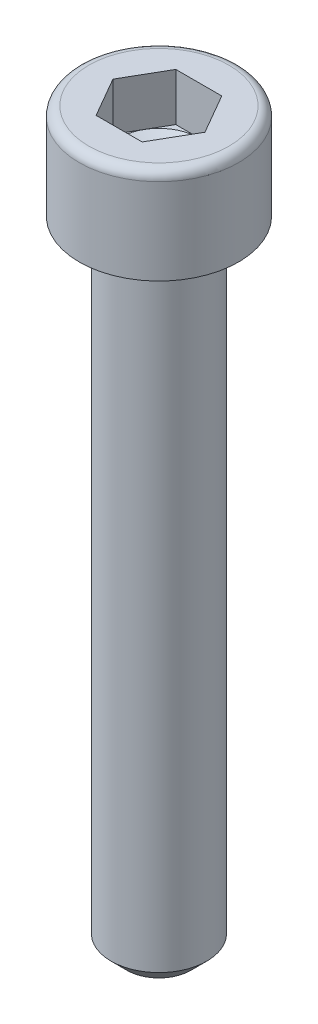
ISO-10303-21;
HEADER;
FILE_DESCRIPTION(('STEP AP214'),'2;1');
FILE_NAME('part.step','',(''),(''),'','','');
FILE_SCHEMA(('AUTOMOTIVE_DESIGN { 1 0 10303 214 1 1 1 1 }'));
ENDSEC;
DATA;
#1=APPLICATION_CONTEXT('core data for automotive mechanical design processes');
#2=APPLICATION_PROTOCOL_DEFINITION('international standard','automotive_design',2000,#1);
#3=PRODUCT_CONTEXT('',#1,'mechanical');
#4=PRODUCT('Part','Part','',(#3));
#5=PRODUCT_RELATED_PRODUCT_CATEGORY('part','',(#4));
#6=PRODUCT_DEFINITION_FORMATION('','',#4);
#7=PRODUCT_DEFINITION_CONTEXT('part definition',#1,'design');
#8=PRODUCT_DEFINITION('design','',#6,#7);
#9=PRODUCT_DEFINITION_SHAPE('','',#8);
#10=(LENGTH_UNIT() NAMED_UNIT(*) SI_UNIT(.MILLI.,.METRE.));
#11=(NAMED_UNIT(*) PLANE_ANGLE_UNIT() SI_UNIT($,.RADIAN.));
#12=(NAMED_UNIT(*) SI_UNIT($,.STERADIAN.) SOLID_ANGLE_UNIT());
#13=UNCERTAINTY_MEASURE_WITH_UNIT(LENGTH_MEASURE(1.E-05),#10,'distance_accuracy_value','');
#14=(GEOMETRIC_REPRESENTATION_CONTEXT(3) GLOBAL_UNCERTAINTY_ASSIGNED_CONTEXT((#13)) GLOBAL_UNIT_ASSIGNED_CONTEXT((#10,
#11,#12)) REPRESENTATION_CONTEXT('',''));
#15=CARTESIAN_POINT('',(0.,0.,0.));
#16=DIRECTION('',(0.,0.,1.));
#17=DIRECTION('',(1.,0.,0.));
#18=AXIS2_PLACEMENT_3D('',#15,#16,#17);
#19=CARTESIAN_POINT('',(-4.330127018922,3.,2.5));
#20=DIRECTION('',(0.,-1.,0.));
#21=DIRECTION('',(0.,0.,-1.));
#22=AXIS2_PLACEMENT_3D('',#19,#20,#21);
#23=PLANE('',#22);
#24=CARTESIAN_POINT('',(0.,2.9999999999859,0.));
#25=DIRECTION('',(0.,1.,0.));
#26=DIRECTION('',(0.,0.,1.));
#27=AXIS2_PLACEMENT_3D('',#24,#25,#26);
#28=CIRCLE('',#27,2.49999999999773);
#29=CARTESIAN_POINT('',(2.16506350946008,2.99999999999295,1.24999999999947));
#30=VERTEX_POINT('',#29);
#31=CARTESIAN_POINT('',(0.,2.99999999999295,2.49999999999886));
#32=VERTEX_POINT('',#31);
#33=EDGE_CURVE('E115',#30,#32,#28,.F.);
#34=ORIENTED_EDGE('',*,*,#33,.T.);
#35=DIRECTION('',(1.,0.,0.));
#36=VECTOR('',#35,1.);
#37=CARTESIAN_POINT('',(-4.330127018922,3.,2.5));
#38=LINE('',#37,#36);
#39=CARTESIAN_POINT('',(1.443375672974,3.,2.5));
#40=VERTEX_POINT('',#39);
#41=EDGE_CURVE('E85',#40,#32,#38,.F.);
#42=ORIENTED_EDGE('',*,*,#41,.F.);
#43=DIRECTION('',(-0.499999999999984,0.,0.866025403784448));
#44=VECTOR('',#43,1.);
#45=CARTESIAN_POINT('',(2.165063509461,3.,1.25));
#46=LINE('',#45,#44);
#47=EDGE_CURVE('E109',#30,#40,#46,.T.);
#48=ORIENTED_EDGE('',*,*,#47,.F.);
#49=EDGE_LOOP('',(#34,#42,#48));
#50=FACE_BOUND('',#49,.T.);
#51=ADVANCED_FACE('F17',(#50),#23,.F.);
#52=CARTESIAN_POINT('',(-4.330127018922,3.,2.5));
#53=DIRECTION('',(0.,-1.,0.));
#54=DIRECTION('',(0.,0.,-1.));
#55=AXIS2_PLACEMENT_3D('',#52,#53,#54);
#56=PLANE('',#55);
#57=CARTESIAN_POINT('',(0.,2.9999999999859,0.));
#58=DIRECTION('',(0.,1.,0.));
#59=DIRECTION('',(0.,0.,1.));
#60=AXIS2_PLACEMENT_3D('',#57,#58,#59);
#61=CIRCLE('',#60,2.49999999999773);
#62=CARTESIAN_POINT('',(-2.16506350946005,2.99999999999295,1.24999999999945));
#63=VERTEX_POINT('',#62);
#64=EDGE_CURVE('E123',#32,#63,#61,.F.);
#65=ORIENTED_EDGE('',*,*,#64,.T.);
#66=DIRECTION('',(-0.499999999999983,0.,-0.866025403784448));
#67=VECTOR('',#66,1.);
#68=CARTESIAN_POINT('',(-1.443375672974,3.,2.5));
#69=LINE('',#68,#67);
#70=CARTESIAN_POINT('',(-1.443375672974,3.,2.5));
#71=VERTEX_POINT('',#70);
#72=EDGE_CURVE('E117',#71,#63,#69,.T.);
#73=ORIENTED_EDGE('',*,*,#72,.F.);
#74=DIRECTION('',(1.,0.,0.));
#75=VECTOR('',#74,1.);
#76=CARTESIAN_POINT('',(-4.330127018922,3.,2.5));
#77=LINE('',#76,#75);
#78=EDGE_CURVE('E273',#32,#71,#77,.F.);
#79=ORIENTED_EDGE('',*,*,#78,.F.);
#80=EDGE_LOOP('',(#65,#73,#79));
#81=FACE_BOUND('',#80,.T.);
#82=ADVANCED_FACE('F296',(#81),#56,.F.);
#83=CARTESIAN_POINT('',(-4.330127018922,3.,2.5));
#84=DIRECTION('',(0.,-1.,0.));
#85=DIRECTION('',(0.,0.,-1.));
#86=AXIS2_PLACEMENT_3D('',#83,#84,#85);
#87=PLANE('',#86);
#88=CARTESIAN_POINT('',(0.,2.9999999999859,0.));
#89=DIRECTION('',(0.,1.,0.));
#90=DIRECTION('',(0.,0.,1.));
#91=AXIS2_PLACEMENT_3D('',#88,#89,#90);
#92=CIRCLE('',#91,2.49999999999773);
#93=CARTESIAN_POINT('',(-2.16506350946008,2.99999999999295,-1.24999999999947));
#94=VERTEX_POINT('',#93);
#95=CARTESIAN_POINT('',(0.,2.99999999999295,-2.49999999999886));
#96=VERTEX_POINT('',#95);
#97=EDGE_CURVE('E103',#94,#96,#92,.F.);
#98=ORIENTED_EDGE('',*,*,#97,.T.);
#99=DIRECTION('',(1.,0.,0.));
#100=VECTOR('',#99,1.);
#101=CARTESIAN_POINT('',(-4.330127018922,3.,-2.5));
#102=LINE('',#101,#100);
#103=CARTESIAN_POINT('',(-1.443375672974,3.,-2.5));
#104=VERTEX_POINT('',#103);
#105=EDGE_CURVE('E128',#104,#96,#102,.T.);
#106=ORIENTED_EDGE('',*,*,#105,.F.);
#107=DIRECTION('',(0.499999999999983,0.,-0.866025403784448));
#108=VECTOR('',#107,1.);
#109=CARTESIAN_POINT('',(-2.165063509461,3.,-1.25));
#110=LINE('',#109,#108);
#111=EDGE_CURVE('E124',#94,#104,#110,.T.);
#112=ORIENTED_EDGE('',*,*,#111,.F.);
#113=EDGE_LOOP('',(#98,#106,#112));
#114=FACE_BOUND('',#113,.T.);
#115=ADVANCED_FACE('F264',(#114),#87,.F.);
#116=CARTESIAN_POINT('',(0.,2.9999999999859,0.));
#117=DIRECTION('',(0.,1.,0.));
#118=DIRECTION('',(0.,0.,1.));
#119=AXIS2_PLACEMENT_3D('',#116,#117,#118);
#120=CONICAL_SURFACE('',#119,2.49999999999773,1.04719755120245);
#121=CARTESIAN_POINT('',(0.,2.9999999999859,0.));
#122=DIRECTION('',(0.,1.,0.));
#123=DIRECTION('',(0.,0.,1.));
#124=AXIS2_PLACEMENT_3D('',#121,#122,#123);
#125=CIRCLE('',#124,2.49999999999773);
#126=EDGE_CURVE('E126',#63,#94,#125,.F.);
#127=ORIENTED_EDGE('',*,*,#126,.F.);
#128=ORIENTED_EDGE('',*,*,#64,.F.);
#129=ORIENTED_EDGE('',*,*,#33,.F.);
#130=CARTESIAN_POINT('',(0.,2.9999999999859,0.));
#131=DIRECTION('',(0.,1.,0.));
#132=DIRECTION('',(0.,0.,1.));
#133=AXIS2_PLACEMENT_3D('',#130,#131,#132);
#134=CIRCLE('',#133,2.49999999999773);
#135=CARTESIAN_POINT('',(2.16506350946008,2.99999999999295,-1.24999999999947));
#136=VERTEX_POINT('',#135);
#137=EDGE_CURVE('E91',#136,#30,#134,.F.);
#138=ORIENTED_EDGE('',*,*,#137,.F.);
#139=CARTESIAN_POINT('',(0.,2.9999999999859,0.));
#140=DIRECTION('',(0.,1.,0.));
#141=DIRECTION('',(0.,0.,1.));
#142=AXIS2_PLACEMENT_3D('',#139,#140,#141);
#143=CIRCLE('',#142,2.49999999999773);
#144=EDGE_CURVE('E102',#136,#96,#143,.T.);
#145=ORIENTED_EDGE('',*,*,#144,.T.);
#146=ORIENTED_EDGE('',*,*,#97,.F.);
#147=EDGE_LOOP('',(#127,#128,#129,#138,#145,#146));
#148=FACE_BOUND('',#147,.T.);
#149=CARTESIAN_POINT('',(0.,1.55662432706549,0.));
#150=VERTEX_POINT('',#149);
#151=VERTEX_LOOP('',#150);
#152=FACE_BOUND('',#151,.T.);
#153=ADVANCED_FACE('F120',(#148,#152),#120,.F.);
#154=CARTESIAN_POINT('',(-4.330127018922,3.,2.5));
#155=DIRECTION('',(0.,-1.,0.));
#156=DIRECTION('',(0.,0.,-1.));
#157=AXIS2_PLACEMENT_3D('',#154,#155,#156);
#158=PLANE('',#157);
#159=ORIENTED_EDGE('',*,*,#144,.F.);
#160=DIRECTION('',(0.500000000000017,0.,0.866025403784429));
#161=VECTOR('',#160,1.);
#162=CARTESIAN_POINT('',(1.443375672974,3.,-2.5));
#163=LINE('',#162,#161);
#164=CARTESIAN_POINT('',(1.443375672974,3.,-2.5));
#165=VERTEX_POINT('',#164);
#166=EDGE_CURVE('E192',#165,#136,#163,.T.);
#167=ORIENTED_EDGE('',*,*,#166,.F.);
#168=DIRECTION('',(1.,0.,0.));
#169=VECTOR('',#168,1.);
#170=CARTESIAN_POINT('',(1.443375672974,3.,-2.5));
#171=LINE('',#170,#169);
#172=EDGE_CURVE('E191',#96,#165,#171,.T.);
#173=ORIENTED_EDGE('',*,*,#172,.F.);
#174=EDGE_LOOP('',(#159,#167,#173));
#175=FACE_BOUND('',#174,.T.);
#176=ADVANCED_FACE('F267',(#175),#158,.F.);
#177=CARTESIAN_POINT('',(-4.330127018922,3.,2.5));
#178=DIRECTION('',(0.,-1.,0.));
#179=DIRECTION('',(0.,0.,-1.));
#180=AXIS2_PLACEMENT_3D('',#177,#178,#179);
#181=PLANE('',#180);
#182=DIRECTION('',(-0.500000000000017,0.,-0.866025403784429));
#183=VECTOR('',#182,1.);
#184=CARTESIAN_POINT('',(-1.443375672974,3.,2.5));
#185=LINE('',#184,#183);
#186=CARTESIAN_POINT('',(-2.88675134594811,3.,0.));
#187=VERTEX_POINT('',#186);
#188=EDGE_CURVE('E203',#63,#187,#185,.T.);
#189=ORIENTED_EDGE('',*,*,#188,.F.);
#190=ORIENTED_EDGE('',*,*,#126,.T.);
#191=DIRECTION('',(0.500000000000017,0.,-0.866025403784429));
#192=VECTOR('',#191,1.);
#193=CARTESIAN_POINT('',(-1.443375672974,3.,-2.5));
#194=LINE('',#193,#192);
#195=EDGE_CURVE('E214',#187,#94,#194,.T.);
#196=ORIENTED_EDGE('',*,*,#195,.F.);
#197=EDGE_LOOP('',(#189,#190,#196));
#198=FACE_BOUND('',#197,.T.);
#199=ADVANCED_FACE('F253',(#198),#181,.F.);
#200=CARTESIAN_POINT('',(-4.330127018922,3.,2.5));
#201=DIRECTION('',(0.,-1.,0.));
#202=DIRECTION('',(0.,0.,-1.));
#203=AXIS2_PLACEMENT_3D('',#200,#201,#202);
#204=PLANE('',#203);
#205=ORIENTED_EDGE('',*,*,#137,.T.);
#206=DIRECTION('',(-0.500000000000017,0.,0.866025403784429));
#207=VECTOR('',#206,1.);
#208=CARTESIAN_POINT('',(1.443375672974,3.,2.5));
#209=LINE('',#208,#207);
#210=CARTESIAN_POINT('',(2.8867513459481,3.,0.));
#211=VERTEX_POINT('',#210);
#212=EDGE_CURVE('E94',#211,#30,#209,.T.);
#213=ORIENTED_EDGE('',*,*,#212,.F.);
#214=DIRECTION('',(0.500000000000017,0.,0.866025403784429));
#215=VECTOR('',#214,1.);
#216=CARTESIAN_POINT('',(1.443375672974,3.,-2.5));
#217=LINE('',#216,#215);
#218=EDGE_CURVE('E96',#136,#211,#217,.T.);
#219=ORIENTED_EDGE('',*,*,#218,.F.);
#220=EDGE_LOOP('',(#205,#213,#219));
#221=FACE_BOUND('',#220,.T.);
#222=ADVANCED_FACE('F93',(#221),#204,.F.);
#223=CARTESIAN_POINT('',(1.443375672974,3.,-2.5));
#224=DIRECTION('',(-0.866025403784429,0.,0.500000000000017));
#225=DIRECTION('',(0.500000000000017,0.,0.866025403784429));
#226=AXIS2_PLACEMENT_3D('',#223,#224,#225);
#227=PLANE('',#226);
#228=DIRECTION('',(0.,1.,0.));
#229=VECTOR('',#228,1.);
#230=CARTESIAN_POINT('',(2.8867513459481,3.,0.));
#231=LINE('',#230,#229);
#232=CARTESIAN_POINT('',(2.8867513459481,6.,0.));
#233=VERTEX_POINT('',#232);
#234=EDGE_CURVE('E111',#233,#211,#231,.F.);
#235=ORIENTED_EDGE('',*,*,#234,.F.);
#236=DIRECTION('',(-0.499999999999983,0.,-0.866025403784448));
#237=VECTOR('',#236,1.);
#238=CARTESIAN_POINT('',(2.886751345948,6.,0.));
#239=LINE('',#238,#237);
#240=CARTESIAN_POINT('',(1.443375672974,6.,-2.5));
#241=VERTEX_POINT('',#240);
#242=EDGE_CURVE('E198',#233,#241,#239,.T.);
#243=ORIENTED_EDGE('',*,*,#242,.T.);
#244=DIRECTION('',(0.,1.,0.));
#245=VECTOR('',#244,1.);
#246=CARTESIAN_POINT('',(1.443375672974,3.,-2.5));
#247=LINE('',#246,#245);
#248=EDGE_CURVE('E217',#165,#241,#247,.T.);
#249=ORIENTED_EDGE('',*,*,#248,.F.);
#250=ORIENTED_EDGE('',*,*,#166,.T.);
#251=ORIENTED_EDGE('',*,*,#218,.T.);
#252=EDGE_LOOP('',(#235,#243,#249,#250,#251));
#253=FACE_BOUND('',#252,.T.);
#254=ADVANCED_FACE('F314',(#253),#227,.T.);
#255=CARTESIAN_POINT('',(1.443375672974,3.,-2.5));
#256=DIRECTION('',(0.,0.,1.));
#257=DIRECTION('',(1.,0.,0.));
#258=AXIS2_PLACEMENT_3D('',#255,#256,#257);
#259=PLANE('',#258);
#260=ORIENTED_EDGE('',*,*,#248,.T.);
#261=DIRECTION('',(1.,0.,0.));
#262=VECTOR('',#261,1.);
#263=CARTESIAN_POINT('',(2.5,6.,-2.5));
#264=LINE('',#263,#262);
#265=CARTESIAN_POINT('',(-1.443375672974,6.,-2.5));
#266=VERTEX_POINT('',#265);
#267=EDGE_CURVE('E171',#241,#266,#264,.F.);
#268=ORIENTED_EDGE('',*,*,#267,.T.);
#269=DIRECTION('',(0.,1.,0.));
#270=VECTOR('',#269,1.);
#271=CARTESIAN_POINT('',(-1.443375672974,3.,-2.5));
#272=LINE('',#271,#270);
#273=EDGE_CURVE('E207',#104,#266,#272,.T.);
#274=ORIENTED_EDGE('',*,*,#273,.F.);
#275=ORIENTED_EDGE('',*,*,#105,.T.);
#276=ORIENTED_EDGE('',*,*,#172,.T.);
#277=EDGE_LOOP('',(#260,#268,#274,#275,#276));
#278=FACE_BOUND('',#277,.T.);
#279=ADVANCED_FACE('F270',(#278),#259,.T.);
#280=CARTESIAN_POINT('',(-1.443375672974,3.,-2.5));
#281=DIRECTION('',(0.866025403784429,0.,0.500000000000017));
#282=DIRECTION('',(0.500000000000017,0.,-0.866025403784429));
#283=AXIS2_PLACEMENT_3D('',#280,#281,#282);
#284=PLANE('',#283);
#285=ORIENTED_EDGE('',*,*,#273,.T.);
#286=DIRECTION('',(-0.499999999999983,0.,0.866025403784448));
#287=VECTOR('',#286,1.);
#288=CARTESIAN_POINT('',(-1.443375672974,6.,-2.5));
#289=LINE('',#288,#287);
#290=CARTESIAN_POINT('',(-2.88675134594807,6.,0.));
#291=VERTEX_POINT('',#290);
#292=EDGE_CURVE('E308',#266,#291,#289,.T.);
#293=ORIENTED_EDGE('',*,*,#292,.T.);
#294=DIRECTION('',(0.,1.,0.));
#295=VECTOR('',#294,1.);
#296=CARTESIAN_POINT('',(-2.8867513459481,3.,0.));
#297=LINE('',#296,#295);
#298=EDGE_CURVE('E206',#187,#291,#297,.T.);
#299=ORIENTED_EDGE('',*,*,#298,.F.);
#300=ORIENTED_EDGE('',*,*,#195,.T.);
#301=ORIENTED_EDGE('',*,*,#111,.T.);
#302=EDGE_LOOP('',(#285,#293,#299,#300,#301));
#303=FACE_BOUND('',#302,.T.);
#304=ADVANCED_FACE('F259',(#303),#284,.T.);
#305=CARTESIAN_POINT('',(-1.443375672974,3.,2.5));
#306=DIRECTION('',(0.866025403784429,0.,-0.500000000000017));
#307=DIRECTION('',(-0.500000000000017,0.,-0.866025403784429));
#308=AXIS2_PLACEMENT_3D('',#305,#306,#307);
#309=PLANE('',#308);
#310=ORIENTED_EDGE('',*,*,#298,.T.);
#311=DIRECTION('',(0.499999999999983,0.,0.866025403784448));
#312=VECTOR('',#311,1.);
#313=CARTESIAN_POINT('',(-2.886751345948,6.,0.));
#314=LINE('',#313,#312);
#315=CARTESIAN_POINT('',(-1.443375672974,6.,2.5));
#316=VERTEX_POINT('',#315);
#317=EDGE_CURVE('E306',#291,#316,#314,.T.);
#318=ORIENTED_EDGE('',*,*,#317,.T.);
#319=DIRECTION('',(0.,1.,0.));
#320=VECTOR('',#319,1.);
#321=CARTESIAN_POINT('',(-1.443375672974,3.,2.5));
#322=LINE('',#321,#320);
#323=EDGE_CURVE('E187',#71,#316,#322,.T.);
#324=ORIENTED_EDGE('',*,*,#323,.F.);
#325=ORIENTED_EDGE('',*,*,#72,.T.);
#326=ORIENTED_EDGE('',*,*,#188,.T.);
#327=EDGE_LOOP('',(#310,#318,#324,#325,#326));
#328=FACE_BOUND('',#327,.T.);
#329=ADVANCED_FACE('F293',(#328),#309,.T.);
#330=CARTESIAN_POINT('',(1.443375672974,3.,2.5));
#331=DIRECTION('',(0.,0.,-1.));
#332=DIRECTION('',(-1.,0.,0.));
#333=AXIS2_PLACEMENT_3D('',#330,#331,#332);
#334=PLANE('',#333);
#335=ORIENTED_EDGE('',*,*,#323,.T.);
#336=DIRECTION('',(1.,0.,0.));
#337=VECTOR('',#336,1.);
#338=CARTESIAN_POINT('',(2.5,6.,2.5));
#339=LINE('',#338,#337);
#340=CARTESIAN_POINT('',(1.443375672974,6.,2.5));
#341=VERTEX_POINT('',#340);
#342=EDGE_CURVE('E148',#316,#341,#339,.T.);
#343=ORIENTED_EDGE('',*,*,#342,.T.);
#344=DIRECTION('',(0.,1.,0.));
#345=VECTOR('',#344,1.);
#346=CARTESIAN_POINT('',(1.443375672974,3.,2.5));
#347=LINE('',#346,#345);
#348=EDGE_CURVE('E112',#40,#341,#347,.T.);
#349=ORIENTED_EDGE('',*,*,#348,.F.);
#350=ORIENTED_EDGE('',*,*,#41,.T.);
#351=ORIENTED_EDGE('',*,*,#78,.T.);
#352=EDGE_LOOP('',(#335,#343,#349,#350,#351));
#353=FACE_BOUND('',#352,.T.);
#354=ADVANCED_FACE('F297',(#353),#334,.T.);
#355=CARTESIAN_POINT('',(1.443375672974,3.,2.5));
#356=DIRECTION('',(-0.866025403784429,0.,-0.500000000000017));
#357=DIRECTION('',(-0.500000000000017,0.,0.866025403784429));
#358=AXIS2_PLACEMENT_3D('',#355,#356,#357);
#359=PLANE('',#358);
#360=ORIENTED_EDGE('',*,*,#348,.T.);
#361=DIRECTION('',(0.499999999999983,0.,-0.866025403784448));
#362=VECTOR('',#361,1.);
#363=CARTESIAN_POINT('',(1.443375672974,6.,2.5));
#364=LINE('',#363,#362);
#365=EDGE_CURVE('E136',#341,#233,#364,.T.);
#366=ORIENTED_EDGE('',*,*,#365,.T.);
#367=ORIENTED_EDGE('',*,*,#234,.T.);
#368=ORIENTED_EDGE('',*,*,#212,.T.);
#369=ORIENTED_EDGE('',*,*,#47,.T.);
#370=EDGE_LOOP('',(#360,#366,#367,#368,#369));
#371=FACE_BOUND('',#370,.T.);
#372=ADVANCED_FACE('F108',(#371),#359,.T.);
#373=CARTESIAN_POINT('',(2.5,6.,0.));
#374=DIRECTION('',(0.,-1.,0.));
#375=DIRECTION('',(0.,0.,-1.));
#376=AXIS2_PLACEMENT_3D('',#373,#374,#375);
#377=PLANE('',#376);
#378=ORIENTED_EDGE('',*,*,#342,.F.);
#379=ORIENTED_EDGE('',*,*,#317,.F.);
#380=ORIENTED_EDGE('',*,*,#292,.F.);
#381=ORIENTED_EDGE('',*,*,#267,.F.);
#382=ORIENTED_EDGE('',*,*,#242,.F.);
#383=ORIENTED_EDGE('',*,*,#365,.F.);
#384=EDGE_LOOP('',(#378,#379,#380,#381,#382,#383));
#385=FACE_BOUND('',#384,.T.);
#386=CARTESIAN_POINT('',(0.,6.,0.));
#387=DIRECTION('',(0.,-1.,0.));
#388=DIRECTION('',(1.,0.,0.));
#389=AXIS2_PLACEMENT_3D('',#386,#387,#388);
#390=CIRCLE('',#389,4.4);
#391=CARTESIAN_POINT('',(4.4,6.,0.));
#392=VERTEX_POINT('',#391);
#393=CARTESIAN_POINT('',(-4.4,6.,0.));
#394=VERTEX_POINT('',#393);
#395=EDGE_CURVE('E37',#392,#394,#390,.T.);
#396=ORIENTED_EDGE('',*,*,#395,.F.);
#397=CARTESIAN_POINT('',(0.,6.,0.));
#398=DIRECTION('',(0.,-1.,0.));
#399=DIRECTION('',(-1.,0.,0.));
#400=AXIS2_PLACEMENT_3D('',#397,#398,#399);
#401=CIRCLE('',#400,4.4);
#402=EDGE_CURVE('E134',#394,#392,#401,.T.);
#403=ORIENTED_EDGE('',*,*,#402,.F.);
#404=EDGE_LOOP('',(#396,#403));
#405=FACE_BOUND('',#404,.T.);
#406=ADVANCED_FACE('F138',(#385,#405),#377,.F.);
#407=CARTESIAN_POINT('',(0.,5.4,0.));
#408=DIRECTION('',(0.,1.,0.));
#409=DIRECTION('',(-1.,0.,0.));
#410=AXIS2_PLACEMENT_3D('',#407,#408,#409);
#411=TOROIDAL_SURFACE('',#410,4.4,0.6);
#412=ORIENTED_EDGE('',*,*,#395,.T.);
#413=ORIENTED_EDGE('',*,*,#402,.T.);
#414=EDGE_LOOP('',(#412,#413));
#415=FACE_BOUND('',#414,.T.);
#416=CARTESIAN_POINT('',(0.,5.4,0.));
#417=DIRECTION('',(0.,1.,0.));
#418=DIRECTION('',(0.,0.,1.));
#419=AXIS2_PLACEMENT_3D('',#416,#417,#418);
#420=CIRCLE('',#419,5.);
#421=CARTESIAN_POINT('',(0.,5.4,5.));
#422=VERTEX_POINT('',#421);
#423=EDGE_CURVE('E139',#422,#422,#420,.F.);
#424=ORIENTED_EDGE('',*,*,#423,.F.);
#425=EDGE_LOOP('',(#424));
#426=FACE_BOUND('',#425,.T.);
#427=ADVANCED_FACE('F132',(#415,#426),#411,.T.);
#428=CARTESIAN_POINT('',(0.,6.,0.));
#429=DIRECTION('',(0.,1.,0.));
#430=DIRECTION('',(0.,0.,1.));
#431=AXIS2_PLACEMENT_3D('',#428,#429,#430);
#432=CYLINDRICAL_SURFACE('',#431,5.);
#433=ORIENTED_EDGE('',*,*,#423,.T.);
#434=EDGE_LOOP('',(#433));
#435=FACE_BOUND('',#434,.T.);
#436=CARTESIAN_POINT('',(0.,0.,0.));
#437=DIRECTION('',(0.,1.,0.));
#438=DIRECTION('',(0.,0.,1.));
#439=AXIS2_PLACEMENT_3D('',#436,#437,#438);
#440=CIRCLE('',#439,5.);
#441=CARTESIAN_POINT('',(0.,0.,5.));
#442=VERTEX_POINT('',#441);
#443=EDGE_CURVE('E175',#442,#442,#440,.T.);
#444=ORIENTED_EDGE('',*,*,#443,.T.);
#445=EDGE_LOOP('',(#444));
#446=FACE_BOUND('',#445,.T.);
#447=ADVANCED_FACE('F165',(#435,#446),#432,.T.);
#448=CARTESIAN_POINT('',(0.,-40.,0.));
#449=DIRECTION('',(0.,1.,0.));
#450=DIRECTION('',(0.,0.,1.));
#451=AXIS2_PLACEMENT_3D('',#448,#449,#450);
#452=PLANE('',#451);
#453=CARTESIAN_POINT('',(0.,-39.9999999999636,0.));
#454=DIRECTION('',(0.,1.,0.));
#455=DIRECTION('',(0.,0.,1.));
#456=AXIS2_PLACEMENT_3D('',#453,#454,#455);
#457=CIRCLE('',#456,2.00000000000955);
#458=CARTESIAN_POINT('',(0.,-39.9999999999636,2.00000000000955));
#459=VERTEX_POINT('',#458);
#460=EDGE_CURVE('E244',#459,#459,#457,.T.);
#461=ORIENTED_EDGE('',*,*,#460,.F.);
#462=EDGE_LOOP('',(#461));
#463=FACE_BOUND('',#462,.T.);
#464=ADVANCED_FACE('F338',(#463),#452,.F.);
#465=CARTESIAN_POINT('',(0.,0.,0.));
#466=DIRECTION('',(0.,1.,0.));
#467=DIRECTION('',(0.,0.,1.));
#468=AXIS2_PLACEMENT_3D('',#465,#466,#467);
#469=PLANE('',#468);
#470=CARTESIAN_POINT('',(0.,0.,0.));
#471=DIRECTION('',(0.,1.,0.));
#472=DIRECTION('',(0.,0.,1.));
#473=AXIS2_PLACEMENT_3D('',#470,#471,#472);
#474=CIRCLE('',#473,3.);
#475=CARTESIAN_POINT('',(0.,0.,3.));
#476=VERTEX_POINT('',#475);
#477=EDGE_CURVE('E29',#476,#476,#474,.F.);
#478=ORIENTED_EDGE('',*,*,#477,.F.);
#479=EDGE_LOOP('',(#478));
#480=FACE_BOUND('',#479,.T.);
#481=ORIENTED_EDGE('',*,*,#443,.F.);
#482=EDGE_LOOP('',(#481));
#483=FACE_BOUND('',#482,.T.);
#484=ADVANCED_FACE('F330',(#480,#483),#469,.F.);
#485=CARTESIAN_POINT('',(0.,-38.9999999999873,0.));
#486=DIRECTION('',(0.,1.,0.));
#487=DIRECTION('',(0.,0.,1.));
#488=AXIS2_PLACEMENT_3D('',#485,#486,#487);
#489=CONICAL_SURFACE('',#488,2.9999999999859,0.785398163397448);
#490=CARTESIAN_POINT('',(0.,-39.,0.));
#491=DIRECTION('',(0.,1.,0.));
#492=DIRECTION('',(0.,0.,1.));
#493=AXIS2_PLACEMENT_3D('',#490,#491,#492);
#494=CIRCLE('',#493,3.);
#495=CARTESIAN_POINT('',(0.,-39.,3.));
#496=VERTEX_POINT('',#495);
#497=EDGE_CURVE('E11',#496,#496,#494,.T.);
#498=ORIENTED_EDGE('',*,*,#497,.F.);
#499=EDGE_LOOP('',(#498));
#500=FACE_BOUND('',#499,.T.);
#501=ORIENTED_EDGE('',*,*,#460,.T.);
#502=EDGE_LOOP('',(#501));
#503=FACE_BOUND('',#502,.T.);
#504=ADVANCED_FACE('F325',(#500,#503),#489,.T.);
#505=CARTESIAN_POINT('',(0.,-40.,0.));
#506=DIRECTION('',(0.,1.,0.));
#507=DIRECTION('',(0.,0.,1.));
#508=AXIS2_PLACEMENT_3D('',#505,#506,#507);
#509=CYLINDRICAL_SURFACE('',#508,3.);
#510=ORIENTED_EDGE('',*,*,#477,.T.);
#511=EDGE_LOOP('',(#510));
#512=FACE_BOUND('',#511,.T.);
#513=ORIENTED_EDGE('',*,*,#497,.T.);
#514=EDGE_LOOP('',(#513));
#515=FACE_BOUND('',#514,.T.);
#516=ADVANCED_FACE('F19',(#512,#515),#509,.T.);
#517=CLOSED_SHELL('',(#51,#82,#115,#153,#176,#199,#222,#254,#279,#304,#329,#354,#372,#406,#427,
#447,#464,#484,#504,#516));
#518=MANIFOLD_SOLID_BREP('B1',#517);
#519=ADVANCED_BREP_SHAPE_REPRESENTATION('',(#18,#518),#14);
#520=SHAPE_DEFINITION_REPRESENTATION(#9,#519);
ENDSEC;
END-ISO-10303-21;
